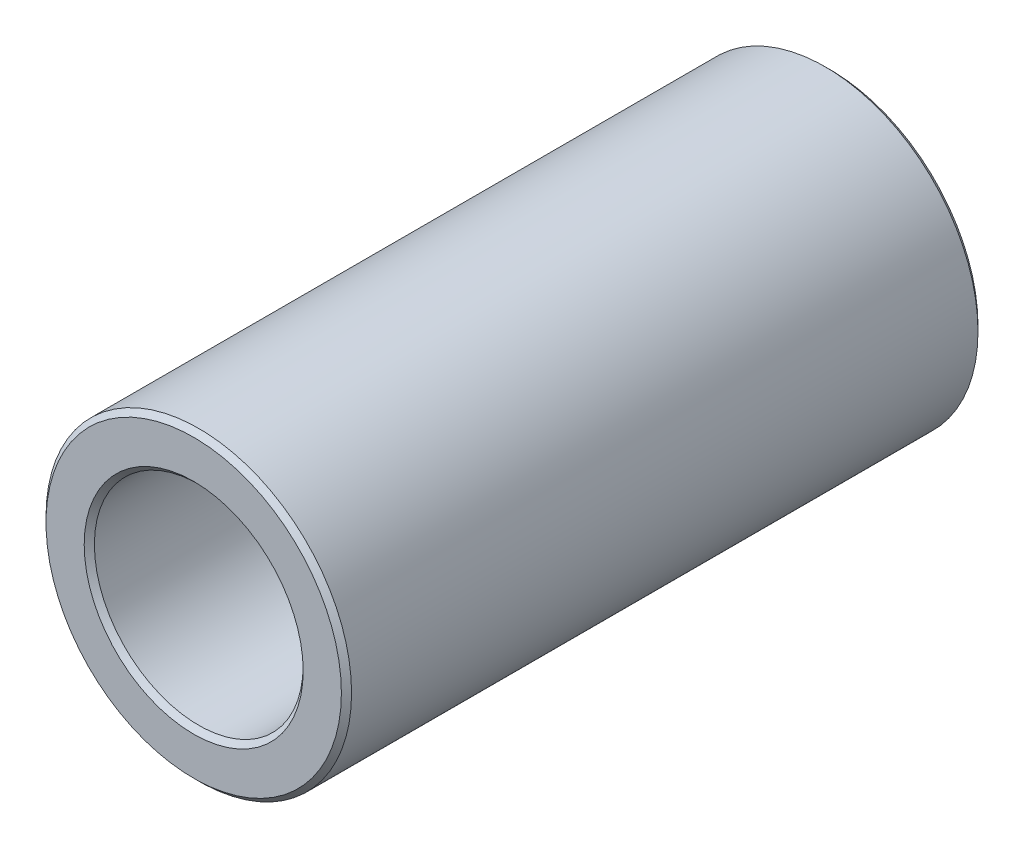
ISO-10303-21;
HEADER;
FILE_DESCRIPTION(('STEP AP214'),'2;1');
FILE_NAME('part.step','',(''),(''),'','','');
FILE_SCHEMA(('AUTOMOTIVE_DESIGN { 1 0 10303 214 1 1 1 1 }'));
ENDSEC;
DATA;
#1=APPLICATION_CONTEXT('core data for automotive mechanical design processes');
#2=APPLICATION_PROTOCOL_DEFINITION('international standard','automotive_design',2000,#1);
#3=PRODUCT_CONTEXT('',#1,'mechanical');
#4=PRODUCT('Part','Part','',(#3));
#5=PRODUCT_RELATED_PRODUCT_CATEGORY('part','',(#4));
#6=PRODUCT_DEFINITION_FORMATION('','',#4);
#7=PRODUCT_DEFINITION_CONTEXT('part definition',#1,'design');
#8=PRODUCT_DEFINITION('design','',#6,#7);
#9=PRODUCT_DEFINITION_SHAPE('','',#8);
#10=(LENGTH_UNIT() NAMED_UNIT(*) SI_UNIT(.MILLI.,.METRE.));
#11=(NAMED_UNIT(*) PLANE_ANGLE_UNIT() SI_UNIT($,.RADIAN.));
#12=(NAMED_UNIT(*) SI_UNIT($,.STERADIAN.) SOLID_ANGLE_UNIT());
#13=UNCERTAINTY_MEASURE_WITH_UNIT(LENGTH_MEASURE(1.E-05),#10,'distance_accuracy_value','');
#14=(GEOMETRIC_REPRESENTATION_CONTEXT(3) GLOBAL_UNCERTAINTY_ASSIGNED_CONTEXT((#13)) GLOBAL_UNIT_ASSIGNED_CONTEXT((#10,
#11,#12)) REPRESENTATION_CONTEXT('',''));
#15=CARTESIAN_POINT('',(0.,0.,0.));
#16=DIRECTION('',(0.,0.,1.));
#17=DIRECTION('',(1.,0.,0.));
#18=AXIS2_PLACEMENT_3D('',#15,#16,#17);
#19=CARTESIAN_POINT('',(0.,0.,12.5));
#20=DIRECTION('',(0.,0.,1.));
#21=DIRECTION('',(1.,0.,0.));
#22=AXIS2_PLACEMENT_3D('',#19,#20,#21);
#23=PLANE('',#22);
#24=CARTESIAN_POINT('',(0.,0.,12.5));
#25=DIRECTION('',(0.,0.,1.));
#26=DIRECTION('',(1.,0.,0.));
#27=AXIS2_PLACEMENT_3D('',#24,#25,#26);
#28=CIRCLE('',#27,4.30000000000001);
#29=CARTESIAN_POINT('',(4.30000000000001,0.,12.5));
#30=VERTEX_POINT('',#29);
#31=EDGE_CURVE('E10',#30,#30,#28,.F.);
#32=ORIENTED_EDGE('',*,*,#31,.T.);
#33=EDGE_LOOP('',(#32));
#34=FACE_BOUND('',#33,.T.);
#35=CARTESIAN_POINT('',(0.,0.,12.5));
#36=DIRECTION('',(0.,0.,1.));
#37=DIRECTION('',(1.,0.,0.));
#38=AXIS2_PLACEMENT_3D('',#35,#36,#37);
#39=CIRCLE('',#38,5.8);
#40=CARTESIAN_POINT('',(5.8,0.,12.5));
#41=VERTEX_POINT('',#40);
#42=EDGE_CURVE('E45',#41,#41,#39,.T.);
#43=ORIENTED_EDGE('',*,*,#42,.T.);
#44=EDGE_LOOP('',(#43));
#45=FACE_BOUND('',#44,.T.);
#46=ADVANCED_FACE('F37',(#34,#45),#23,.T.);
#47=CARTESIAN_POINT('',(0.,0.,-12.5));
#48=DIRECTION('',(0.,0.,1.));
#49=DIRECTION('',(1.,0.,0.));
#50=AXIS2_PLACEMENT_3D('',#47,#48,#49);
#51=PLANE('',#50);
#52=CARTESIAN_POINT('',(0.,0.,-12.5));
#53=DIRECTION('',(0.,0.,1.));
#54=DIRECTION('',(1.,0.,0.));
#55=AXIS2_PLACEMENT_3D('',#52,#53,#54);
#56=CIRCLE('',#55,5.8);
#57=CARTESIAN_POINT('',(5.8,0.,-12.5));
#58=VERTEX_POINT('',#57);
#59=EDGE_CURVE('E64',#58,#58,#56,.F.);
#60=ORIENTED_EDGE('',*,*,#59,.T.);
#61=EDGE_LOOP('',(#60));
#62=FACE_BOUND('',#61,.T.);
#63=CARTESIAN_POINT('',(0.,0.,-12.5));
#64=DIRECTION('',(0.,0.,1.));
#65=DIRECTION('',(1.,0.,0.));
#66=AXIS2_PLACEMENT_3D('',#63,#64,#65);
#67=CIRCLE('',#66,4.3);
#68=CARTESIAN_POINT('',(4.3,0.,-12.5));
#69=VERTEX_POINT('',#68);
#70=EDGE_CURVE('E67',#69,#69,#67,.T.);
#71=ORIENTED_EDGE('',*,*,#70,.T.);
#72=EDGE_LOOP('',(#71));
#73=FACE_BOUND('',#72,.T.);
#74=ADVANCED_FACE('F89',(#62,#73),#51,.F.);
#75=CARTESIAN_POINT('',(0.,0.,12.5));
#76=DIRECTION('',(0.,0.,-1.));
#77=DIRECTION('',(-1.,0.,0.));
#78=AXIS2_PLACEMENT_3D('',#75,#76,#77);
#79=CYLINDRICAL_SURFACE('',#78,6.);
#80=CARTESIAN_POINT('',(0.,0.,-12.3));
#81=DIRECTION('',(0.,0.,1.));
#82=DIRECTION('',(1.,0.,0.));
#83=AXIS2_PLACEMENT_3D('',#80,#81,#82);
#84=CIRCLE('',#83,6.);
#85=CARTESIAN_POINT('',(6.,0.,-12.3));
#86=VERTEX_POINT('',#85);
#87=EDGE_CURVE('E71',#86,#86,#84,.T.);
#88=ORIENTED_EDGE('',*,*,#87,.T.);
#89=EDGE_LOOP('',(#88));
#90=FACE_BOUND('',#89,.T.);
#91=CARTESIAN_POINT('',(0.,0.,12.3));
#92=DIRECTION('',(0.,0.,1.));
#93=DIRECTION('',(1.,0.,0.));
#94=AXIS2_PLACEMENT_3D('',#91,#92,#93);
#95=CIRCLE('',#94,6.);
#96=CARTESIAN_POINT('',(6.,0.,12.3));
#97=VERTEX_POINT('',#96);
#98=EDGE_CURVE('E74',#97,#97,#95,.F.);
#99=ORIENTED_EDGE('',*,*,#98,.T.);
#100=EDGE_LOOP('',(#99));
#101=FACE_BOUND('',#100,.T.);
#102=ADVANCED_FACE('F78',(#90,#101),#79,.T.);
#103=CARTESIAN_POINT('',(0.,0.,12.5));
#104=DIRECTION('',(0.,0.,-1.));
#105=DIRECTION('',(-1.,0.,0.));
#106=AXIS2_PLACEMENT_3D('',#103,#104,#105);
#107=CYLINDRICAL_SURFACE('',#106,4.1);
#108=CARTESIAN_POINT('',(0.,0.,-12.3));
#109=DIRECTION('',(0.,0.,1.));
#110=DIRECTION('',(1.,0.,0.));
#111=AXIS2_PLACEMENT_3D('',#108,#109,#110);
#112=CIRCLE('',#111,4.1);
#113=CARTESIAN_POINT('',(4.1,0.,-12.3));
#114=VERTEX_POINT('',#113);
#115=EDGE_CURVE('E52',#114,#114,#112,.F.);
#116=ORIENTED_EDGE('',*,*,#115,.T.);
#117=EDGE_LOOP('',(#116));
#118=FACE_BOUND('',#117,.T.);
#119=CARTESIAN_POINT('',(0.,0.,12.3));
#120=DIRECTION('',(0.,0.,1.));
#121=DIRECTION('',(1.,0.,0.));
#122=AXIS2_PLACEMENT_3D('',#119,#120,#121);
#123=CIRCLE('',#122,4.1);
#124=CARTESIAN_POINT('',(4.1,0.,12.3));
#125=VERTEX_POINT('',#124);
#126=EDGE_CURVE('E59',#125,#125,#123,.T.);
#127=ORIENTED_EDGE('',*,*,#126,.T.);
#128=EDGE_LOOP('',(#127));
#129=FACE_BOUND('',#128,.T.);
#130=ADVANCED_FACE('F97',(#118,#129),#107,.F.);
#131=CARTESIAN_POINT('',(0.,0.,-12.3));
#132=DIRECTION('',(0.,0.,1.));
#133=DIRECTION('',(1.,0.,0.));
#134=AXIS2_PLACEMENT_3D('',#131,#132,#133);
#135=CONICAL_SURFACE('',#134,6.,0.785398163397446);
#136=ORIENTED_EDGE('',*,*,#59,.F.);
#137=EDGE_LOOP('',(#136));
#138=FACE_BOUND('',#137,.T.);
#139=ORIENTED_EDGE('',*,*,#87,.F.);
#140=EDGE_LOOP('',(#139));
#141=FACE_BOUND('',#140,.T.);
#142=ADVANCED_FACE('F102',(#138,#141),#135,.T.);
#143=CARTESIAN_POINT('',(0.,0.,-12.5));
#144=DIRECTION('',(0.,0.,-1.));
#145=DIRECTION('',(-1.,0.,0.));
#146=AXIS2_PLACEMENT_3D('',#143,#144,#145);
#147=CONICAL_SURFACE('',#146,4.3,0.785398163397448);
#148=ORIENTED_EDGE('',*,*,#115,.F.);
#149=EDGE_LOOP('',(#148));
#150=FACE_BOUND('',#149,.T.);
#151=ORIENTED_EDGE('',*,*,#70,.F.);
#152=EDGE_LOOP('',(#151));
#153=FACE_BOUND('',#152,.T.);
#154=ADVANCED_FACE('F86',(#150,#153),#147,.F.);
#155=CARTESIAN_POINT('',(0.,0.,12.3));
#156=DIRECTION('',(0.,0.,1.));
#157=DIRECTION('',(1.,0.,0.));
#158=AXIS2_PLACEMENT_3D('',#155,#156,#157);
#159=CONICAL_SURFACE('',#158,4.1,0.785398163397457);
#160=ORIENTED_EDGE('',*,*,#31,.F.);
#161=EDGE_LOOP('',(#160));
#162=FACE_BOUND('',#161,.T.);
#163=ORIENTED_EDGE('',*,*,#126,.F.);
#164=EDGE_LOOP('',(#163));
#165=FACE_BOUND('',#164,.T.);
#166=ADVANCED_FACE('F82',(#162,#165),#159,.F.);
#167=CARTESIAN_POINT('',(0.,0.,12.5));
#168=DIRECTION('',(0.,0.,-1.));
#169=DIRECTION('',(-1.,0.,0.));
#170=AXIS2_PLACEMENT_3D('',#167,#168,#169);
#171=CONICAL_SURFACE('',#170,5.8,0.78539816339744);
#172=ORIENTED_EDGE('',*,*,#98,.F.);
#173=EDGE_LOOP('',(#172));
#174=FACE_BOUND('',#173,.T.);
#175=ORIENTED_EDGE('',*,*,#42,.F.);
#176=EDGE_LOOP('',(#175));
#177=FACE_BOUND('',#176,.T.);
#178=ADVANCED_FACE('F39',(#174,#177),#171,.T.);
#179=CLOSED_SHELL('',(#46,#74,#102,#130,#142,#154,#166,#178));
#180=MANIFOLD_SOLID_BREP('B2',#179);
#181=ADVANCED_BREP_SHAPE_REPRESENTATION('',(#18,#180),#14);
#182=SHAPE_DEFINITION_REPRESENTATION(#9,#181);
ENDSEC;
END-ISO-10303-21;
